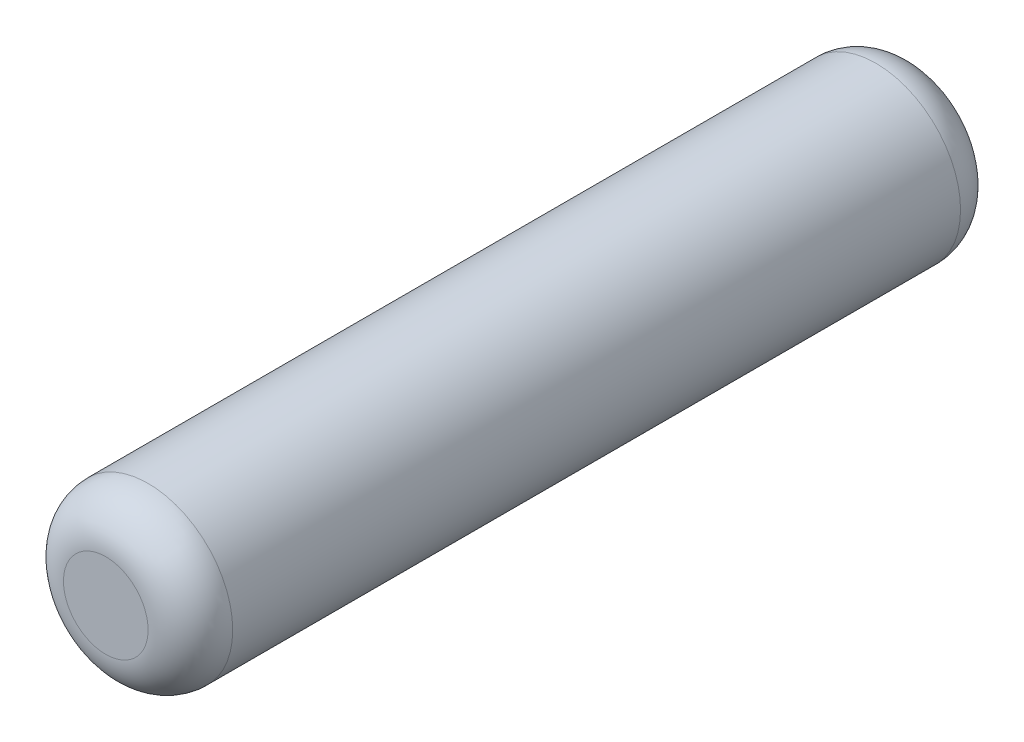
ISO-10303-21;
HEADER;
FILE_DESCRIPTION(('STEP AP214'),'2;1');
FILE_NAME('part.step','',(''),(''),'','','');
FILE_SCHEMA(('AUTOMOTIVE_DESIGN { 1 0 10303 214 1 1 1 1 }'));
ENDSEC;
DATA;
#1=APPLICATION_CONTEXT('core data for automotive mechanical design processes');
#2=APPLICATION_PROTOCOL_DEFINITION('international standard','automotive_design',2000,#1);
#3=PRODUCT_CONTEXT('',#1,'mechanical');
#4=PRODUCT('Part','Part','',(#3));
#5=PRODUCT_RELATED_PRODUCT_CATEGORY('part','',(#4));
#6=PRODUCT_DEFINITION_FORMATION('','',#4);
#7=PRODUCT_DEFINITION_CONTEXT('part definition',#1,'design');
#8=PRODUCT_DEFINITION('design','',#6,#7);
#9=PRODUCT_DEFINITION_SHAPE('','',#8);
#10=(LENGTH_UNIT() NAMED_UNIT(*) SI_UNIT(.MILLI.,.METRE.));
#11=(NAMED_UNIT(*) PLANE_ANGLE_UNIT() SI_UNIT($,.RADIAN.));
#12=(NAMED_UNIT(*) SI_UNIT($,.STERADIAN.) SOLID_ANGLE_UNIT());
#13=UNCERTAINTY_MEASURE_WITH_UNIT(LENGTH_MEASURE(1.E-05),#10,'distance_accuracy_value','');
#14=(GEOMETRIC_REPRESENTATION_CONTEXT(3) GLOBAL_UNCERTAINTY_ASSIGNED_CONTEXT((#13)) GLOBAL_UNIT_ASSIGNED_CONTEXT((#10,
#11,#12)) REPRESENTATION_CONTEXT('',''));
#15=CARTESIAN_POINT('',(0.,0.,0.));
#16=DIRECTION('',(0.,0.,1.));
#17=DIRECTION('',(1.,0.,0.));
#18=AXIS2_PLACEMENT_3D('',#15,#16,#17);
#19=CARTESIAN_POINT('',(0.,0.,19.2));
#20=DIRECTION('',(0.,0.,-1.));
#21=DIRECTION('',(-1.,0.,0.));
#22=AXIS2_PLACEMENT_3D('',#19,#20,#21);
#23=PLANE('',#22);
#24=CARTESIAN_POINT('',(2.50006888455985E-07,6.93542510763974E-12,19.2000000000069));
#25=DIRECTION('',(3.4694472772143E-12,3.4694472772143E-12,1.));
#26=DIRECTION('',(0.,-1.,3.4694472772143E-12));
#27=AXIS2_PLACEMENT_3D('',#24,#25,#26);
#28=CIRCLE('',#27,1.99999974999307);
#29=CARTESIAN_POINT('',(2.50006888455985E-07,-1.99999974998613,19.2000000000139));
#30=VERTEX_POINT('',#29);
#31=EDGE_CURVE('E18',#30,#30,#28,.F.);
#32=ORIENTED_EDGE('',*,*,#31,.F.);
#33=EDGE_LOOP('',(#32));
#34=FACE_BOUND('',#33,.T.);
#35=ADVANCED_FACE('F14',(#34),#23,.F.);
#36=CARTESIAN_POINT('',(0.,0.,-19.2));
#37=DIRECTION('',(0.,0.,-1.));
#38=DIRECTION('',(-1.,0.,0.));
#39=AXIS2_PLACEMENT_3D('',#36,#37,#38);
#40=PLANE('',#39);
#41=CARTESIAN_POINT('',(-2.50006888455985E-07,6.93542510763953E-12,-19.2000000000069));
#42=DIRECTION('',(-3.4694472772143E-12,3.4694472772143E-12,-1.));
#43=DIRECTION('',(0.,1.,3.4694472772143E-12));
#44=AXIS2_PLACEMENT_3D('',#41,#42,#43);
#45=CIRCLE('',#44,2.00000025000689);
#46=CARTESIAN_POINT('',(-2.50006888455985E-07,2.00000025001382,-19.1999999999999));
#47=VERTEX_POINT('',#46);
#48=EDGE_CURVE('E27',#47,#47,#45,.F.);
#49=ORIENTED_EDGE('',*,*,#48,.F.);
#50=EDGE_LOOP('',(#49));
#51=FACE_BOUND('',#50,.T.);
#52=ADVANCED_FACE('F38',(#51),#40,.T.);
#53=CARTESIAN_POINT('',(2.4999994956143E-07,0.,17.2000000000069));
#54=DIRECTION('',(3.4694472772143E-12,3.4694472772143E-12,1.));
#55=DIRECTION('',(0.,-1.,3.4694472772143E-12));
#56=AXIS2_PLACEMENT_3D('',#53,#54,#55);
#57=DEGENERATE_TOROIDAL_SURFACE('',#56,1.99999975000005,2.,.T.);
#58=CARTESIAN_POINT('',(0.,0.,17.2));
#59=DIRECTION('',(0.,0.,1.));
#60=DIRECTION('',(1.,0.,0.));
#61=AXIS2_PLACEMENT_3D('',#58,#59,#60);
#62=CIRCLE('',#61,4.);
#63=CARTESIAN_POINT('',(4.,0.,17.2));
#64=VERTEX_POINT('',#63);
#65=EDGE_CURVE('E22',#64,#64,#62,.F.);
#66=ORIENTED_EDGE('',*,*,#65,.F.);
#67=EDGE_LOOP('',(#66));
#68=FACE_BOUND('',#67,.T.);
#69=ORIENTED_EDGE('',*,*,#31,.T.);
#70=EDGE_LOOP('',(#69));
#71=FACE_BOUND('',#70,.T.);
#72=ADVANCED_FACE('F35',(#68,#71),#57,.T.);
#73=CARTESIAN_POINT('',(-2.4999994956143E-07,0.,-17.2000000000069));
#74=DIRECTION('',(-3.4694472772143E-12,3.4694472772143E-12,-1.));
#75=DIRECTION('',(0.,1.,3.4694472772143E-12));
#76=AXIS2_PLACEMENT_3D('',#73,#74,#75);
#77=DEGENERATE_TOROIDAL_SURFACE('',#76,1.99999975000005,2.,.T.);
#78=CARTESIAN_POINT('',(0.,0.,-17.2));
#79=DIRECTION('',(0.,0.,1.));
#80=DIRECTION('',(1.,0.,0.));
#81=AXIS2_PLACEMENT_3D('',#78,#79,#80);
#82=CIRCLE('',#81,4.);
#83=CARTESIAN_POINT('',(4.,0.,-17.2));
#84=VERTEX_POINT('',#83);
#85=EDGE_CURVE('E10',#84,#84,#82,.T.);
#86=ORIENTED_EDGE('',*,*,#85,.F.);
#87=EDGE_LOOP('',(#86));
#88=FACE_BOUND('',#87,.T.);
#89=ORIENTED_EDGE('',*,*,#48,.T.);
#90=EDGE_LOOP('',(#89));
#91=FACE_BOUND('',#90,.T.);
#92=ADVANCED_FACE('F16',(#88,#91),#77,.T.);
#93=CARTESIAN_POINT('',(0.,0.,0.));
#94=DIRECTION('',(0.,0.,1.));
#95=DIRECTION('',(1.,0.,0.));
#96=AXIS2_PLACEMENT_3D('',#93,#94,#95);
#97=CYLINDRICAL_SURFACE('',#96,4.);
#98=ORIENTED_EDGE('',*,*,#85,.T.);
#99=EDGE_LOOP('',(#98));
#100=FACE_BOUND('',#99,.T.);
#101=ORIENTED_EDGE('',*,*,#65,.T.);
#102=EDGE_LOOP('',(#101));
#103=FACE_BOUND('',#102,.T.);
#104=ADVANCED_FACE('F46',(#100,#103),#97,.T.);
#105=CLOSED_SHELL('',(#35,#52,#72,#92,#104));
#106=MANIFOLD_SOLID_BREP('B1',#105);
#107=ADVANCED_BREP_SHAPE_REPRESENTATION('',(#18,#106),#14);
#108=SHAPE_DEFINITION_REPRESENTATION(#9,#107);
ENDSEC;
END-ISO-10303-21;
